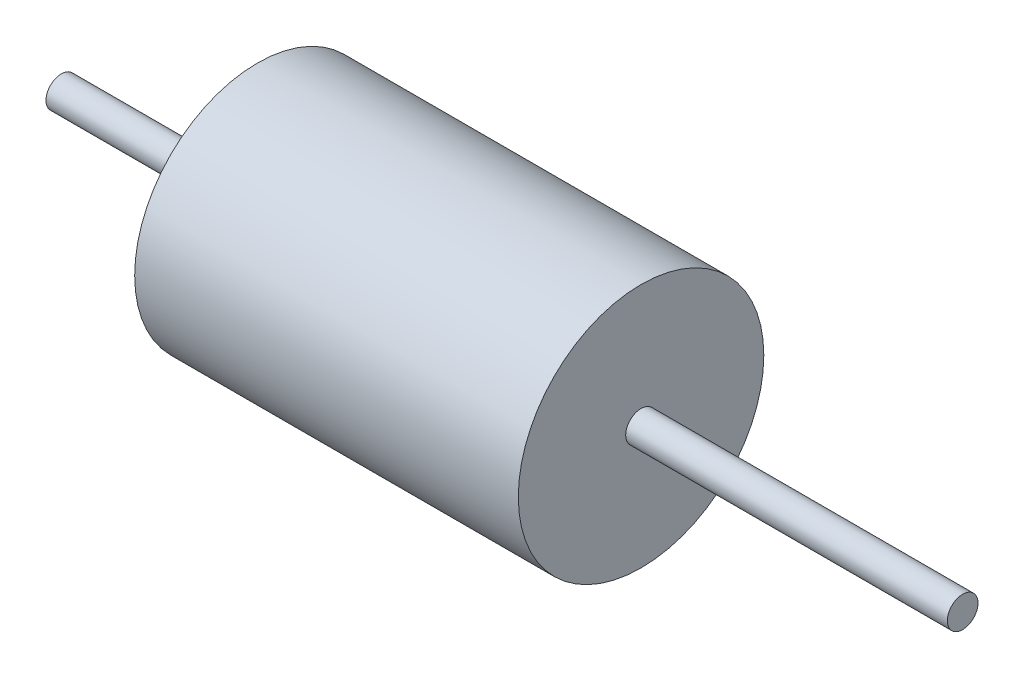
from build123d import *

# Parameters (mm, degrees)
ESQUISSE3_W      = 117.47812968
ESQUISSE3_H      = 2
ESQUISSE4_R      = 16
EXTRUSION1_DEPTH = 50


with BuildPart() as part:
    # Esquisse3 → R_volution1 (revolve)
    with BuildSketch(Plane.XY):
        with Locations((80.627615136, -198)):
            Rectangle(ESQUISSE3_W, ESQUISSE3_H)
    revolve(axis=Axis((220.79076548, -199, 0), (-1, 0, 0)))

    # Esquisse4 → Extrusion1 (add)
    with BuildSketch(Plane(origin=(47.44777991, 0, 0), x_dir=(0, 0, -1), z_dir=(1, 0, 0))):
        with Locations(Location((0, -199, 0), (0, 0, 90))):
            Circle(ESQUISSE4_R)
    extrude(amount=EXTRUSION1_DEPTH)


solid = part.part
